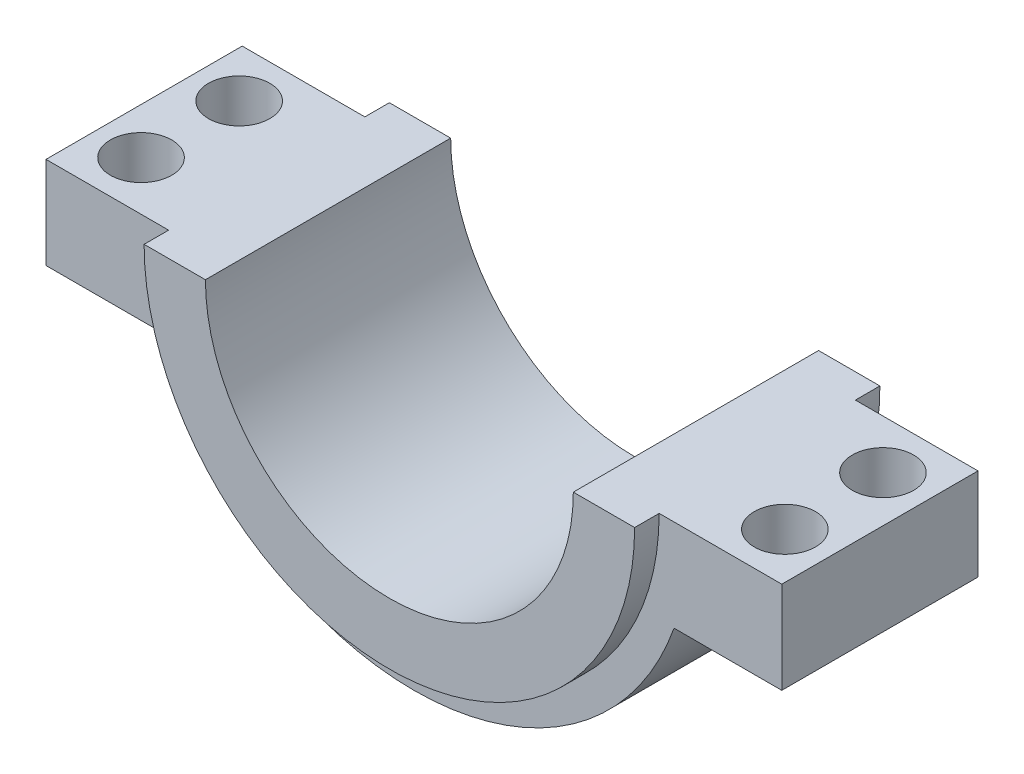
ISO-10303-21;
HEADER;
FILE_DESCRIPTION(('STEP AP214'),'2;1');
FILE_NAME('part.step','',(''),(''),'','','');
FILE_SCHEMA(('AUTOMOTIVE_DESIGN { 1 0 10303 214 1 1 1 1 }'));
ENDSEC;
DATA;
#1=APPLICATION_CONTEXT('core data for automotive mechanical design processes');
#2=APPLICATION_PROTOCOL_DEFINITION('international standard','automotive_design',2000,#1);
#3=PRODUCT_CONTEXT('',#1,'mechanical');
#4=PRODUCT('Part','Part','',(#3));
#5=PRODUCT_RELATED_PRODUCT_CATEGORY('part','',(#4));
#6=PRODUCT_DEFINITION_FORMATION('','',#4);
#7=PRODUCT_DEFINITION_CONTEXT('part definition',#1,'design');
#8=PRODUCT_DEFINITION('design','',#6,#7);
#9=PRODUCT_DEFINITION_SHAPE('','',#8);
#10=(LENGTH_UNIT() NAMED_UNIT(*) SI_UNIT(.MILLI.,.METRE.));
#11=(NAMED_UNIT(*) PLANE_ANGLE_UNIT() SI_UNIT($,.RADIAN.));
#12=(NAMED_UNIT(*) SI_UNIT($,.STERADIAN.) SOLID_ANGLE_UNIT());
#13=UNCERTAINTY_MEASURE_WITH_UNIT(LENGTH_MEASURE(1.E-05),#10,'distance_accuracy_value','');
#14=(GEOMETRIC_REPRESENTATION_CONTEXT(3) GLOBAL_UNCERTAINTY_ASSIGNED_CONTEXT((#13)) GLOBAL_UNIT_ASSIGNED_CONTEXT((#10,
#11,#12)) REPRESENTATION_CONTEXT('',''));
#15=CARTESIAN_POINT('',(0.,0.,0.));
#16=DIRECTION('',(0.,0.,1.));
#17=DIRECTION('',(1.,0.,0.));
#18=AXIS2_PLACEMENT_3D('',#15,#16,#17);
#19=CARTESIAN_POINT('',(0.,0.,16.));
#20=DIRECTION('',(0.,-1.,0.));
#21=DIRECTION('',(1.,0.,0.));
#22=AXIS2_PLACEMENT_3D('',#19,#20,#21);
#23=PLANE('',#22);
#24=CARTESIAN_POINT('',(-52.5,0.,-8.));
#25=DIRECTION('',(0.,1.,0.));
#26=DIRECTION('',(-1.,0.,0.));
#27=AXIS2_PLACEMENT_3D('',#24,#25,#26);
#28=CIRCLE('',#27,5.);
#29=CARTESIAN_POINT('',(-57.5,0.,-8.));
#30=VERTEX_POINT('',#29);
#31=EDGE_CURVE('E159',#30,#30,#28,.T.);
#32=ORIENTED_EDGE('',*,*,#31,.F.);
#33=EDGE_LOOP('',(#32));
#34=FACE_BOUND('',#33,.T.);
#35=CARTESIAN_POINT('',(-52.5,0.,8.));
#36=DIRECTION('',(0.,1.,0.));
#37=DIRECTION('',(-1.,0.,0.));
#38=AXIS2_PLACEMENT_3D('',#35,#36,#37);
#39=CIRCLE('',#38,5.);
#40=CARTESIAN_POINT('',(-57.5,0.,8.));
#41=VERTEX_POINT('',#40);
#42=EDGE_CURVE('E165',#41,#41,#39,.T.);
#43=ORIENTED_EDGE('',*,*,#42,.F.);
#44=EDGE_LOOP('',(#43));
#45=FACE_BOUND('',#44,.T.);
#46=DIRECTION('',(-1.,0.,0.));
#47=VECTOR('',#46,1.);
#48=CARTESIAN_POINT('',(0.,0.,-16.));
#49=LINE('',#48,#47);
#50=CARTESIAN_POINT('',(-40.,0.,-16.));
#51=VERTEX_POINT('',#50);
#52=CARTESIAN_POINT('',(-60.,0.,-16.));
#53=VERTEX_POINT('',#52);
#54=EDGE_CURVE('E136',#51,#53,#49,.T.);
#55=ORIENTED_EDGE('',*,*,#54,.T.);
#56=DIRECTION('',(0.,0.,-1.));
#57=VECTOR('',#56,1.);
#58=CARTESIAN_POINT('',(-60.,0.,16.));
#59=LINE('',#58,#57);
#60=CARTESIAN_POINT('',(-60.,0.,16.));
#61=VERTEX_POINT('',#60);
#62=EDGE_CURVE('E11',#61,#53,#59,.T.);
#63=ORIENTED_EDGE('',*,*,#62,.F.);
#64=DIRECTION('',(-1.,0.,0.));
#65=VECTOR('',#64,1.);
#66=CARTESIAN_POINT('',(0.,0.,16.));
#67=LINE('',#66,#65);
#68=CARTESIAN_POINT('',(-40.,0.,16.));
#69=VERTEX_POINT('',#68);
#70=EDGE_CURVE('E93',#69,#61,#67,.T.);
#71=ORIENTED_EDGE('',*,*,#70,.F.);
#72=DIRECTION('',(0.,0.,-1.));
#73=VECTOR('',#72,1.);
#74=CARTESIAN_POINT('',(-40.,0.,20.));
#75=LINE('',#74,#73);
#76=CARTESIAN_POINT('',(-40.,0.,20.));
#77=VERTEX_POINT('',#76);
#78=EDGE_CURVE('E137',#77,#69,#75,.T.);
#79=ORIENTED_EDGE('',*,*,#78,.F.);
#80=DIRECTION('',(-1.,0.,0.));
#81=VECTOR('',#80,1.);
#82=CARTESIAN_POINT('',(0.,0.,20.));
#83=LINE('',#82,#81);
#84=CARTESIAN_POINT('',(-30.,0.,20.));
#85=VERTEX_POINT('',#84);
#86=EDGE_CURVE('E175',#85,#77,#83,.T.);
#87=ORIENTED_EDGE('',*,*,#86,.F.);
#88=DIRECTION('',(0.,0.,-1.));
#89=VECTOR('',#88,1.);
#90=CARTESIAN_POINT('',(-30.,0.,20.));
#91=LINE('',#90,#89);
#92=CARTESIAN_POINT('',(-30.,0.,-20.));
#93=VERTEX_POINT('',#92);
#94=EDGE_CURVE('E188',#85,#93,#91,.T.);
#95=ORIENTED_EDGE('',*,*,#94,.T.);
#96=DIRECTION('',(-1.,0.,0.));
#97=VECTOR('',#96,1.);
#98=CARTESIAN_POINT('',(0.,0.,-20.));
#99=LINE('',#98,#97);
#100=CARTESIAN_POINT('',(-40.,0.,-20.));
#101=VERTEX_POINT('',#100);
#102=EDGE_CURVE('E163',#93,#101,#99,.T.);
#103=ORIENTED_EDGE('',*,*,#102,.T.);
#104=EDGE_CURVE('E206',#51,#101,#75,.T.);
#105=ORIENTED_EDGE('',*,*,#104,.F.);
#106=EDGE_LOOP('',(#55,#63,#71,#79,#87,#95,#103,#105));
#107=FACE_BOUND('',#106,.T.);
#108=ADVANCED_FACE('F34',(#34,#45,#107),#23,.F.);
#109=CARTESIAN_POINT('',(-60.,0.,16.));
#110=DIRECTION('',(1.,0.,0.));
#111=DIRECTION('',(0.,0.,-1.));
#112=AXIS2_PLACEMENT_3D('',#109,#110,#111);
#113=PLANE('',#112);
#114=DIRECTION('',(0.,-1.,0.));
#115=VECTOR('',#114,1.);
#116=CARTESIAN_POINT('',(-60.,0.,-16.));
#117=LINE('',#116,#115);
#118=CARTESIAN_POINT('',(-60.,-15.,-16.));
#119=VERTEX_POINT('',#118);
#120=EDGE_CURVE('E139',#53,#119,#117,.T.);
#121=ORIENTED_EDGE('',*,*,#120,.T.);
#122=DIRECTION('',(0.,0.,-1.));
#123=VECTOR('',#122,1.);
#124=CARTESIAN_POINT('',(-60.,-15.,16.));
#125=LINE('',#124,#123);
#126=CARTESIAN_POINT('',(-60.,-15.,16.));
#127=VERTEX_POINT('',#126);
#128=EDGE_CURVE('E43',#127,#119,#125,.T.);
#129=ORIENTED_EDGE('',*,*,#128,.F.);
#130=DIRECTION('',(0.,-1.,0.));
#131=VECTOR('',#130,1.);
#132=CARTESIAN_POINT('',(-60.,0.,16.));
#133=LINE('',#132,#131);
#134=EDGE_CURVE('E212',#61,#127,#133,.T.);
#135=ORIENTED_EDGE('',*,*,#134,.F.);
#136=ORIENTED_EDGE('',*,*,#62,.T.);
#137=EDGE_LOOP('',(#121,#129,#135,#136));
#138=FACE_BOUND('',#137,.T.);
#139=ADVANCED_FACE('F216',(#138),#113,.F.);
#140=CARTESIAN_POINT('',(0.,-15.,16.));
#141=DIRECTION('',(0.,1.,0.));
#142=DIRECTION('',(0.,0.,1.));
#143=AXIS2_PLACEMENT_3D('',#140,#141,#142);
#144=PLANE('',#143);
#145=CARTESIAN_POINT('',(-52.5,-15.,-8.));
#146=DIRECTION('',(0.,1.,0.));
#147=DIRECTION('',(0.,0.,1.));
#148=AXIS2_PLACEMENT_3D('',#145,#146,#147);
#149=CIRCLE('',#148,5.);
#150=CARTESIAN_POINT('',(-52.5,-15.,-3.));
#151=VERTEX_POINT('',#150);
#152=EDGE_CURVE('E37',#151,#151,#149,.T.);
#153=ORIENTED_EDGE('',*,*,#152,.T.);
#154=EDGE_LOOP('',(#153));
#155=FACE_BOUND('',#154,.T.);
#156=CARTESIAN_POINT('',(-52.5,-15.,8.));
#157=DIRECTION('',(0.,1.,0.));
#158=DIRECTION('',(0.,0.,1.));
#159=AXIS2_PLACEMENT_3D('',#156,#157,#158);
#160=CIRCLE('',#159,5.);
#161=CARTESIAN_POINT('',(-52.5,-15.,13.));
#162=VERTEX_POINT('',#161);
#163=EDGE_CURVE('E157',#162,#162,#160,.T.);
#164=ORIENTED_EDGE('',*,*,#163,.T.);
#165=EDGE_LOOP('',(#164));
#166=FACE_BOUND('',#165,.T.);
#167=DIRECTION('',(1.,0.,0.));
#168=VECTOR('',#167,1.);
#169=CARTESIAN_POINT('',(0.,-15.,-16.));
#170=LINE('',#169,#168);
#171=CARTESIAN_POINT('',(-42.4264068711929,-15.,-16.));
#172=VERTEX_POINT('',#171);
#173=EDGE_CURVE('E141',#119,#172,#170,.T.);
#174=ORIENTED_EDGE('',*,*,#173,.T.);
#175=DIRECTION('',(0.,0.,-1.));
#176=VECTOR('',#175,1.);
#177=CARTESIAN_POINT('',(-42.4264068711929,-15.,16.));
#178=LINE('',#177,#176);
#179=CARTESIAN_POINT('',(-42.4264068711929,-15.,16.));
#180=VERTEX_POINT('',#179);
#181=EDGE_CURVE('E123',#180,#172,#178,.T.);
#182=ORIENTED_EDGE('',*,*,#181,.F.);
#183=DIRECTION('',(1.,0.,0.));
#184=VECTOR('',#183,1.);
#185=CARTESIAN_POINT('',(0.,-15.,16.));
#186=LINE('',#185,#184);
#187=EDGE_CURVE('E110',#127,#180,#186,.T.);
#188=ORIENTED_EDGE('',*,*,#187,.F.);
#189=ORIENTED_EDGE('',*,*,#128,.T.);
#190=EDGE_LOOP('',(#174,#182,#188,#189));
#191=FACE_BOUND('',#190,.T.);
#192=ADVANCED_FACE('F220',(#155,#166,#191),#144,.F.);
#193=CARTESIAN_POINT('',(0.,0.,16.));
#194=DIRECTION('',(0.,0.,-1.));
#195=DIRECTION('',(-1.,0.,0.));
#196=AXIS2_PLACEMENT_3D('',#193,#194,#195);
#197=CYLINDRICAL_SURFACE('',#196,45.);
#198=CARTESIAN_POINT('',(0.,0.,-16.));
#199=DIRECTION('',(0.,0.,1.));
#200=DIRECTION('',(1.,0.,0.));
#201=AXIS2_PLACEMENT_3D('',#198,#199,#200);
#202=CIRCLE('',#201,45.);
#203=CARTESIAN_POINT('',(42.4264068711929,-15.,-16.));
#204=VERTEX_POINT('',#203);
#205=EDGE_CURVE('E119',#172,#204,#202,.T.);
#206=ORIENTED_EDGE('',*,*,#205,.T.);
#207=DIRECTION('',(0.,0.,-1.));
#208=VECTOR('',#207,1.);
#209=CARTESIAN_POINT('',(42.4264068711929,-15.,16.));
#210=LINE('',#209,#208);
#211=CARTESIAN_POINT('',(42.4264068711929,-15.,16.));
#212=VERTEX_POINT('',#211);
#213=EDGE_CURVE('E116',#212,#204,#210,.T.);
#214=ORIENTED_EDGE('',*,*,#213,.F.);
#215=CARTESIAN_POINT('',(0.,0.,16.));
#216=DIRECTION('',(0.,0.,1.));
#217=DIRECTION('',(1.,0.,0.));
#218=AXIS2_PLACEMENT_3D('',#215,#216,#217);
#219=CIRCLE('',#218,45.);
#220=EDGE_CURVE('E104',#180,#212,#219,.T.);
#221=ORIENTED_EDGE('',*,*,#220,.F.);
#222=ORIENTED_EDGE('',*,*,#181,.T.);
#223=EDGE_LOOP('',(#206,#214,#221,#222));
#224=FACE_BOUND('',#223,.T.);
#225=ADVANCED_FACE('F117',(#224),#197,.T.);
#226=CARTESIAN_POINT('',(0.,-15.,16.));
#227=DIRECTION('',(0.,-1.,0.));
#228=DIRECTION('',(0.,0.,-1.));
#229=AXIS2_PLACEMENT_3D('',#226,#227,#228);
#230=PLANE('',#229);
#231=CARTESIAN_POINT('',(52.5,-15.,-8.));
#232=DIRECTION('',(0.,-1.,0.));
#233=DIRECTION('',(0.,0.,-1.));
#234=AXIS2_PLACEMENT_3D('',#231,#232,#233);
#235=CIRCLE('',#234,5.);
#236=CARTESIAN_POINT('',(52.5,-15.,-13.));
#237=VERTEX_POINT('',#236);
#238=EDGE_CURVE('E170',#237,#237,#235,.F.);
#239=ORIENTED_EDGE('',*,*,#238,.T.);
#240=EDGE_LOOP('',(#239));
#241=FACE_BOUND('',#240,.T.);
#242=CARTESIAN_POINT('',(52.5,-15.,8.));
#243=DIRECTION('',(0.,-1.,0.));
#244=DIRECTION('',(0.,0.,-1.));
#245=AXIS2_PLACEMENT_3D('',#242,#243,#244);
#246=CIRCLE('',#245,5.);
#247=CARTESIAN_POINT('',(52.5,-15.,3.));
#248=VERTEX_POINT('',#247);
#249=EDGE_CURVE('E312',#248,#248,#246,.F.);
#250=ORIENTED_EDGE('',*,*,#249,.T.);
#251=EDGE_LOOP('',(#250));
#252=FACE_BOUND('',#251,.T.);
#253=DIRECTION('',(-1.,0.,0.));
#254=VECTOR('',#253,1.);
#255=CARTESIAN_POINT('',(0.,-15.,-16.));
#256=LINE('',#255,#254);
#257=CARTESIAN_POINT('',(60.,-15.,-16.));
#258=VERTEX_POINT('',#257);
#259=EDGE_CURVE('E144',#258,#204,#256,.T.);
#260=ORIENTED_EDGE('',*,*,#259,.F.);
#261=DIRECTION('',(0.,0.,-1.));
#262=VECTOR('',#261,1.);
#263=CARTESIAN_POINT('',(60.,-15.,16.));
#264=LINE('',#263,#262);
#265=CARTESIAN_POINT('',(60.,-15.,16.));
#266=VERTEX_POINT('',#265);
#267=EDGE_CURVE('E124',#266,#258,#264,.T.);
#268=ORIENTED_EDGE('',*,*,#267,.F.);
#269=DIRECTION('',(-1.,0.,0.));
#270=VECTOR('',#269,1.);
#271=CARTESIAN_POINT('',(0.,-15.,16.));
#272=LINE('',#271,#270);
#273=EDGE_CURVE('E108',#266,#212,#272,.T.);
#274=ORIENTED_EDGE('',*,*,#273,.T.);
#275=ORIENTED_EDGE('',*,*,#213,.T.);
#276=EDGE_LOOP('',(#260,#268,#274,#275));
#277=FACE_BOUND('',#276,.T.);
#278=ADVANCED_FACE('F126',(#241,#252,#277),#230,.T.);
#279=CARTESIAN_POINT('',(60.,0.,16.));
#280=DIRECTION('',(1.,0.,0.));
#281=DIRECTION('',(0.,0.,-1.));
#282=AXIS2_PLACEMENT_3D('',#279,#280,#281);
#283=PLANE('',#282);
#284=DIRECTION('',(0.,-1.,0.));
#285=VECTOR('',#284,1.);
#286=CARTESIAN_POINT('',(60.,0.,-16.));
#287=LINE('',#286,#285);
#288=CARTESIAN_POINT('',(60.,0.,-16.));
#289=VERTEX_POINT('',#288);
#290=EDGE_CURVE('E146',#289,#258,#287,.T.);
#291=ORIENTED_EDGE('',*,*,#290,.F.);
#292=DIRECTION('',(0.,0.,-1.));
#293=VECTOR('',#292,1.);
#294=CARTESIAN_POINT('',(60.,0.,16.));
#295=LINE('',#294,#293);
#296=CARTESIAN_POINT('',(60.,0.,16.));
#297=VERTEX_POINT('',#296);
#298=EDGE_CURVE('E52',#297,#289,#295,.T.);
#299=ORIENTED_EDGE('',*,*,#298,.F.);
#300=DIRECTION('',(0.,-1.,0.));
#301=VECTOR('',#300,1.);
#302=CARTESIAN_POINT('',(60.,0.,16.));
#303=LINE('',#302,#301);
#304=EDGE_CURVE('E127',#297,#266,#303,.T.);
#305=ORIENTED_EDGE('',*,*,#304,.T.);
#306=ORIENTED_EDGE('',*,*,#267,.T.);
#307=EDGE_LOOP('',(#291,#299,#305,#306));
#308=FACE_BOUND('',#307,.T.);
#309=ADVANCED_FACE('F223',(#308),#283,.T.);
#310=CARTESIAN_POINT('',(0.,0.,16.));
#311=DIRECTION('',(0.,1.,0.));
#312=DIRECTION('',(-1.,0.,0.));
#313=AXIS2_PLACEMENT_3D('',#310,#311,#312);
#314=PLANE('',#313);
#315=CARTESIAN_POINT('',(52.5,0.,-8.));
#316=DIRECTION('',(0.,-1.,0.));
#317=DIRECTION('',(1.,0.,0.));
#318=AXIS2_PLACEMENT_3D('',#315,#316,#317);
#319=CIRCLE('',#318,5.);
#320=CARTESIAN_POINT('',(57.5,0.,-8.));
#321=VERTEX_POINT('',#320);
#322=EDGE_CURVE('E310',#321,#321,#319,.T.);
#323=ORIENTED_EDGE('',*,*,#322,.T.);
#324=EDGE_LOOP('',(#323));
#325=FACE_BOUND('',#324,.T.);
#326=CARTESIAN_POINT('',(52.5,0.,8.));
#327=DIRECTION('',(0.,-1.,0.));
#328=DIRECTION('',(1.,0.,0.));
#329=AXIS2_PLACEMENT_3D('',#326,#327,#328);
#330=CIRCLE('',#329,5.);
#331=CARTESIAN_POINT('',(57.5,0.,8.));
#332=VERTEX_POINT('',#331);
#333=EDGE_CURVE('E313',#332,#332,#330,.T.);
#334=ORIENTED_EDGE('',*,*,#333,.T.);
#335=EDGE_LOOP('',(#334));
#336=FACE_BOUND('',#335,.T.);
#337=DIRECTION('',(1.,0.,0.));
#338=VECTOR('',#337,1.);
#339=CARTESIAN_POINT('',(0.,0.,-16.));
#340=LINE('',#339,#338);
#341=CARTESIAN_POINT('',(40.,0.,-16.));
#342=VERTEX_POINT('',#341);
#343=EDGE_CURVE('E149',#342,#289,#340,.T.);
#344=ORIENTED_EDGE('',*,*,#343,.F.);
#345=DIRECTION('',(0.,0.,-1.));
#346=VECTOR('',#345,1.);
#347=CARTESIAN_POINT('',(40.,0.,20.));
#348=LINE('',#347,#346);
#349=CARTESIAN_POINT('',(40.,0.,-20.));
#350=VERTEX_POINT('',#349);
#351=EDGE_CURVE('E84',#342,#350,#348,.T.);
#352=ORIENTED_EDGE('',*,*,#351,.T.);
#353=DIRECTION('',(1.,0.,0.));
#354=VECTOR('',#353,1.);
#355=CARTESIAN_POINT('',(0.,0.,-20.));
#356=LINE('',#355,#354);
#357=CARTESIAN_POINT('',(30.,0.,-20.));
#358=VERTEX_POINT('',#357);
#359=EDGE_CURVE('E193',#358,#350,#356,.T.);
#360=ORIENTED_EDGE('',*,*,#359,.F.);
#361=DIRECTION('',(0.,0.,-1.));
#362=VECTOR('',#361,1.);
#363=CARTESIAN_POINT('',(30.,0.,20.));
#364=LINE('',#363,#362);
#365=CARTESIAN_POINT('',(30.,0.,20.));
#366=VERTEX_POINT('',#365);
#367=EDGE_CURVE('E200',#366,#358,#364,.T.);
#368=ORIENTED_EDGE('',*,*,#367,.F.);
#369=DIRECTION('',(1.,0.,0.));
#370=VECTOR('',#369,1.);
#371=CARTESIAN_POINT('',(0.,0.,20.));
#372=LINE('',#371,#370);
#373=CARTESIAN_POINT('',(40.,0.,20.));
#374=VERTEX_POINT('',#373);
#375=EDGE_CURVE('E182',#366,#374,#372,.T.);
#376=ORIENTED_EDGE('',*,*,#375,.T.);
#377=CARTESIAN_POINT('',(40.,0.,16.));
#378=VERTEX_POINT('',#377);
#379=EDGE_CURVE('E203',#374,#378,#348,.T.);
#380=ORIENTED_EDGE('',*,*,#379,.T.);
#381=DIRECTION('',(1.,0.,0.));
#382=VECTOR('',#381,1.);
#383=CARTESIAN_POINT('',(0.,0.,16.));
#384=LINE('',#383,#382);
#385=EDGE_CURVE('E129',#378,#297,#384,.T.);
#386=ORIENTED_EDGE('',*,*,#385,.T.);
#387=ORIENTED_EDGE('',*,*,#298,.T.);
#388=EDGE_LOOP('',(#344,#352,#360,#368,#376,#380,#386,#387));
#389=FACE_BOUND('',#388,.T.);
#390=ADVANCED_FACE('F226',(#325,#336,#389),#314,.T.);
#391=CARTESIAN_POINT('',(0.,0.,16.));
#392=DIRECTION('',(0.,0.,1.));
#393=DIRECTION('',(1.,0.,0.));
#394=AXIS2_PLACEMENT_3D('',#391,#392,#393);
#395=PLANE('',#394);
#396=CARTESIAN_POINT('',(0.,0.,16.));
#397=DIRECTION('',(0.,0.,1.));
#398=DIRECTION('',(1.,0.,0.));
#399=AXIS2_PLACEMENT_3D('',#396,#397,#398);
#400=CIRCLE('',#399,40.);
#401=EDGE_CURVE('E152',#69,#378,#400,.T.);
#402=ORIENTED_EDGE('',*,*,#401,.F.);
#403=ORIENTED_EDGE('',*,*,#70,.T.);
#404=ORIENTED_EDGE('',*,*,#134,.T.);
#405=ORIENTED_EDGE('',*,*,#187,.T.);
#406=ORIENTED_EDGE('',*,*,#220,.T.);
#407=ORIENTED_EDGE('',*,*,#273,.F.);
#408=ORIENTED_EDGE('',*,*,#304,.F.);
#409=ORIENTED_EDGE('',*,*,#385,.F.);
#410=EDGE_LOOP('',(#402,#403,#404,#405,#406,#407,#408,#409));
#411=FACE_BOUND('',#410,.T.);
#412=ADVANCED_FACE('F106',(#411),#395,.T.);
#413=CARTESIAN_POINT('',(0.,0.,-16.));
#414=DIRECTION('',(0.,0.,1.));
#415=DIRECTION('',(1.,0.,0.));
#416=AXIS2_PLACEMENT_3D('',#413,#414,#415);
#417=PLANE('',#416);
#418=CARTESIAN_POINT('',(0.,0.,-16.));
#419=DIRECTION('',(0.,0.,1.));
#420=DIRECTION('',(1.,0.,0.));
#421=AXIS2_PLACEMENT_3D('',#418,#419,#420);
#422=CIRCLE('',#421,40.);
#423=EDGE_CURVE('E134',#51,#342,#422,.T.);
#424=ORIENTED_EDGE('',*,*,#423,.T.);
#425=ORIENTED_EDGE('',*,*,#343,.T.);
#426=ORIENTED_EDGE('',*,*,#290,.T.);
#427=ORIENTED_EDGE('',*,*,#259,.T.);
#428=ORIENTED_EDGE('',*,*,#205,.F.);
#429=ORIENTED_EDGE('',*,*,#173,.F.);
#430=ORIENTED_EDGE('',*,*,#120,.F.);
#431=ORIENTED_EDGE('',*,*,#54,.F.);
#432=EDGE_LOOP('',(#424,#425,#426,#427,#428,#429,#430,#431));
#433=FACE_BOUND('',#432,.T.);
#434=ADVANCED_FACE('F222',(#433),#417,.F.);
#435=CARTESIAN_POINT('',(0.,0.,20.));
#436=DIRECTION('',(0.,0.,-1.));
#437=DIRECTION('',(-1.,0.,0.));
#438=AXIS2_PLACEMENT_3D('',#435,#436,#437);
#439=CYLINDRICAL_SURFACE('',#438,40.);
#440=ORIENTED_EDGE('',*,*,#351,.F.);
#441=ORIENTED_EDGE('',*,*,#423,.F.);
#442=ORIENTED_EDGE('',*,*,#104,.T.);
#443=CARTESIAN_POINT('',(0.,0.,-20.));
#444=DIRECTION('',(0.,0.,1.));
#445=DIRECTION('',(1.,0.,0.));
#446=AXIS2_PLACEMENT_3D('',#443,#444,#445);
#447=CIRCLE('',#446,40.);
#448=EDGE_CURVE('E191',#101,#350,#447,.T.);
#449=ORIENTED_EDGE('',*,*,#448,.T.);
#450=EDGE_LOOP('',(#440,#441,#442,#449));
#451=FACE_BOUND('',#450,.T.);
#452=ADVANCED_FACE('F256',(#451),#439,.T.);
#453=ORIENTED_EDGE('',*,*,#401,.T.);
#454=ORIENTED_EDGE('',*,*,#379,.F.);
#455=CARTESIAN_POINT('',(0.,0.,20.));
#456=DIRECTION('',(0.,0.,1.));
#457=DIRECTION('',(1.,0.,0.));
#458=AXIS2_PLACEMENT_3D('',#455,#456,#457);
#459=CIRCLE('',#458,40.);
#460=EDGE_CURVE('E178',#77,#374,#459,.T.);
#461=ORIENTED_EDGE('',*,*,#460,.F.);
#462=ORIENTED_EDGE('',*,*,#78,.T.);
#463=EDGE_LOOP('',(#453,#454,#461,#462));
#464=FACE_BOUND('',#463,.T.);
#465=ADVANCED_FACE('F236',(#464),#439,.T.);
#466=CARTESIAN_POINT('',(0.,0.,20.));
#467=DIRECTION('',(0.,0.,-1.));
#468=DIRECTION('',(-1.,0.,0.));
#469=AXIS2_PLACEMENT_3D('',#466,#467,#468);
#470=CYLINDRICAL_SURFACE('',#469,30.);
#471=CARTESIAN_POINT('',(0.,0.,-20.));
#472=DIRECTION('',(0.,0.,1.));
#473=DIRECTION('',(1.,0.,0.));
#474=AXIS2_PLACEMENT_3D('',#471,#472,#473);
#475=CIRCLE('',#474,30.);
#476=EDGE_CURVE('E179',#93,#358,#475,.T.);
#477=ORIENTED_EDGE('',*,*,#476,.F.);
#478=ORIENTED_EDGE('',*,*,#94,.F.);
#479=CARTESIAN_POINT('',(0.,0.,20.));
#480=DIRECTION('',(0.,0.,1.));
#481=DIRECTION('',(1.,0.,0.));
#482=AXIS2_PLACEMENT_3D('',#479,#480,#481);
#483=CIRCLE('',#482,30.);
#484=EDGE_CURVE('E185',#85,#366,#483,.T.);
#485=ORIENTED_EDGE('',*,*,#484,.T.);
#486=ORIENTED_EDGE('',*,*,#367,.T.);
#487=EDGE_LOOP('',(#477,#478,#485,#486));
#488=FACE_BOUND('',#487,.T.);
#489=ADVANCED_FACE('F266',(#488),#470,.F.);
#490=CARTESIAN_POINT('',(0.,0.,20.));
#491=DIRECTION('',(0.,0.,1.));
#492=DIRECTION('',(1.,0.,0.));
#493=AXIS2_PLACEMENT_3D('',#490,#491,#492);
#494=PLANE('',#493);
#495=ORIENTED_EDGE('',*,*,#86,.T.);
#496=ORIENTED_EDGE('',*,*,#460,.T.);
#497=ORIENTED_EDGE('',*,*,#375,.F.);
#498=ORIENTED_EDGE('',*,*,#484,.F.);
#499=EDGE_LOOP('',(#495,#496,#497,#498));
#500=FACE_BOUND('',#499,.T.);
#501=ADVANCED_FACE('F269',(#500),#494,.T.);
#502=CARTESIAN_POINT('',(0.,0.,-20.));
#503=DIRECTION('',(0.,0.,1.));
#504=DIRECTION('',(1.,0.,0.));
#505=AXIS2_PLACEMENT_3D('',#502,#503,#504);
#506=PLANE('',#505);
#507=ORIENTED_EDGE('',*,*,#102,.F.);
#508=ORIENTED_EDGE('',*,*,#476,.T.);
#509=ORIENTED_EDGE('',*,*,#359,.T.);
#510=ORIENTED_EDGE('',*,*,#448,.F.);
#511=EDGE_LOOP('',(#507,#508,#509,#510));
#512=FACE_BOUND('',#511,.T.);
#513=ADVANCED_FACE('F264',(#512),#506,.F.);
#514=CARTESIAN_POINT('',(-52.5,-45.,8.));
#515=DIRECTION('',(0.,1.,0.));
#516=DIRECTION('',(-1.,0.,0.));
#517=AXIS2_PLACEMENT_3D('',#514,#515,#516);
#518=CYLINDRICAL_SURFACE('',#517,5.);
#519=ORIENTED_EDGE('',*,*,#42,.T.);
#520=EDGE_LOOP('',(#519));
#521=FACE_BOUND('',#520,.T.);
#522=ORIENTED_EDGE('',*,*,#163,.F.);
#523=EDGE_LOOP('',(#522));
#524=FACE_BOUND('',#523,.T.);
#525=ADVANCED_FACE('F276',(#521,#524),#518,.F.);
#526=CARTESIAN_POINT('',(-52.5,-45.,-8.));
#527=DIRECTION('',(0.,1.,0.));
#528=DIRECTION('',(-1.,0.,0.));
#529=AXIS2_PLACEMENT_3D('',#526,#527,#528);
#530=CYLINDRICAL_SURFACE('',#529,5.);
#531=ORIENTED_EDGE('',*,*,#31,.T.);
#532=EDGE_LOOP('',(#531));
#533=FACE_BOUND('',#532,.T.);
#534=ORIENTED_EDGE('',*,*,#152,.F.);
#535=EDGE_LOOP('',(#534));
#536=FACE_BOUND('',#535,.T.);
#537=ADVANCED_FACE('F290',(#533,#536),#530,.F.);
#538=CARTESIAN_POINT('',(52.5,-45.,8.));
#539=DIRECTION('',(0.,1.,0.));
#540=DIRECTION('',(-1.,0.,0.));
#541=AXIS2_PLACEMENT_3D('',#538,#539,#540);
#542=CYLINDRICAL_SURFACE('',#541,5.);
#543=ORIENTED_EDGE('',*,*,#249,.F.);
#544=EDGE_LOOP('',(#543));
#545=FACE_BOUND('',#544,.T.);
#546=ORIENTED_EDGE('',*,*,#333,.F.);
#547=EDGE_LOOP('',(#546));
#548=FACE_BOUND('',#547,.T.);
#549=ADVANCED_FACE('F294',(#545,#548),#542,.F.);
#550=CARTESIAN_POINT('',(52.5,-45.,-8.));
#551=DIRECTION('',(0.,1.,0.));
#552=DIRECTION('',(-1.,0.,0.));
#553=AXIS2_PLACEMENT_3D('',#550,#551,#552);
#554=CYLINDRICAL_SURFACE('',#553,5.);
#555=ORIENTED_EDGE('',*,*,#238,.F.);
#556=EDGE_LOOP('',(#555));
#557=FACE_BOUND('',#556,.T.);
#558=ORIENTED_EDGE('',*,*,#322,.F.);
#559=EDGE_LOOP('',(#558));
#560=FACE_BOUND('',#559,.T.);
#561=ADVANCED_FACE('F299',(#557,#560),#554,.F.);
#562=CLOSED_SHELL('',(#108,#139,#192,#225,#278,#309,#390,#412,#434,#452,#465,#489,#501,#513,
#525,#537,#549,#561));
#563=MANIFOLD_SOLID_BREP('B2',#562);
#564=ADVANCED_BREP_SHAPE_REPRESENTATION('',(#18,#563),#14);
#565=SHAPE_DEFINITION_REPRESENTATION(#9,#564);
ENDSEC;
END-ISO-10303-21;
